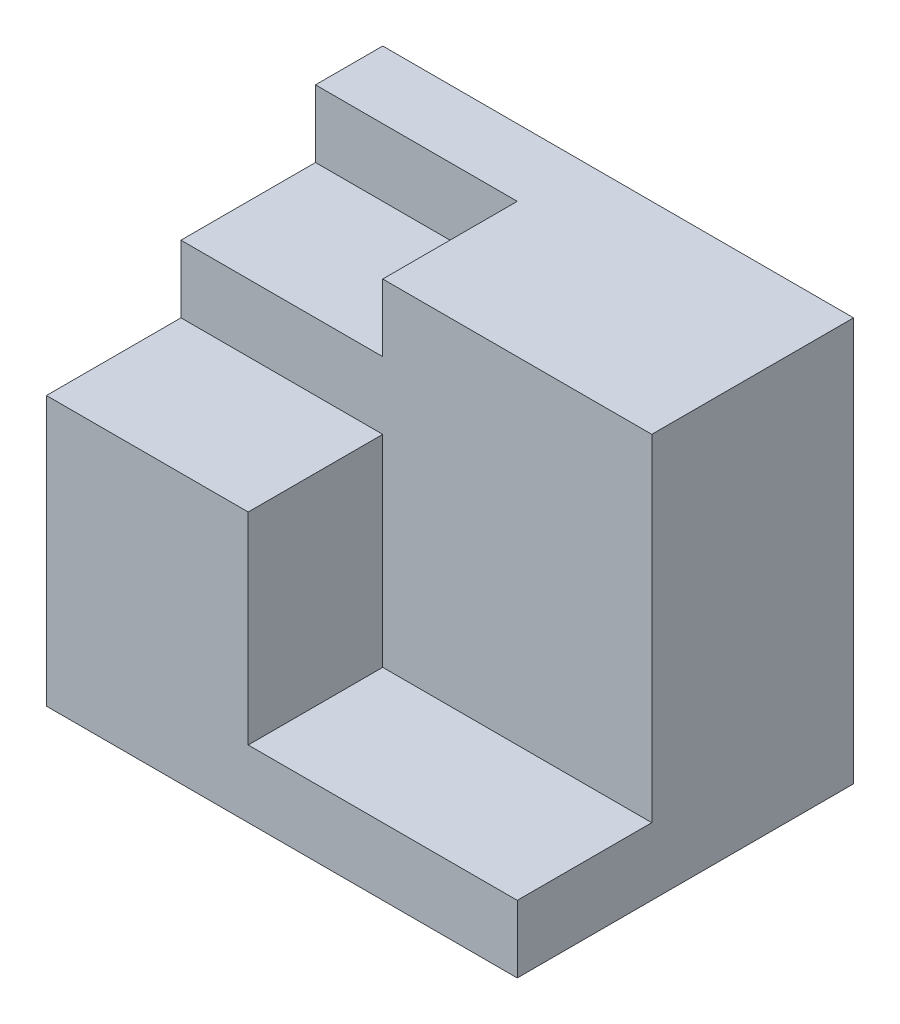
from build123d import *

# Parameters (mm, degrees)
CROQUIS1_W              = 70
CROQUIS1_H              = 60
SALIENTE_EXTRUIR1_DEPTH = 25
CORTAR_EXTRUIR4_DEPTH   = 20
CROQUIS6_W              = 30
CROQUIS6_H              = 10
CORTAR_EXTRUIR5_DEPTH   = 20


with BuildPart() as part:
    # Croquis1 → Saliente-Extruir1 (new, symmetric)
    with BuildSketch(Plane.XY):
        Rectangle(CROQUIS1_W, CROQUIS1_H)
    extrude(amount=SALIENTE_EXTRUIR1_DEPTH, both=True)

    # Croquis5 → Cortar-Extruir4 (cut)
    with BuildSketch(Plane.XY.offset(25)):
        Polygon((-35, 10), (-5, 10), (-5, -20), (35, -20), (35, 30), (-35, 30), align=None)
    extrude(amount=-CORTAR_EXTRUIR4_DEPTH, mode=Mode.SUBTRACT)

    # Croquis6 → Cortar-Extruir5 (cut)
    with BuildSketch(Plane.XY.offset(5)):
        with Locations((-20, 25)):
            Rectangle(CROQUIS6_W, CROQUIS6_H)
    extrude(amount=-CORTAR_EXTRUIR5_DEPTH, mode=Mode.SUBTRACT)


solid = part.part
